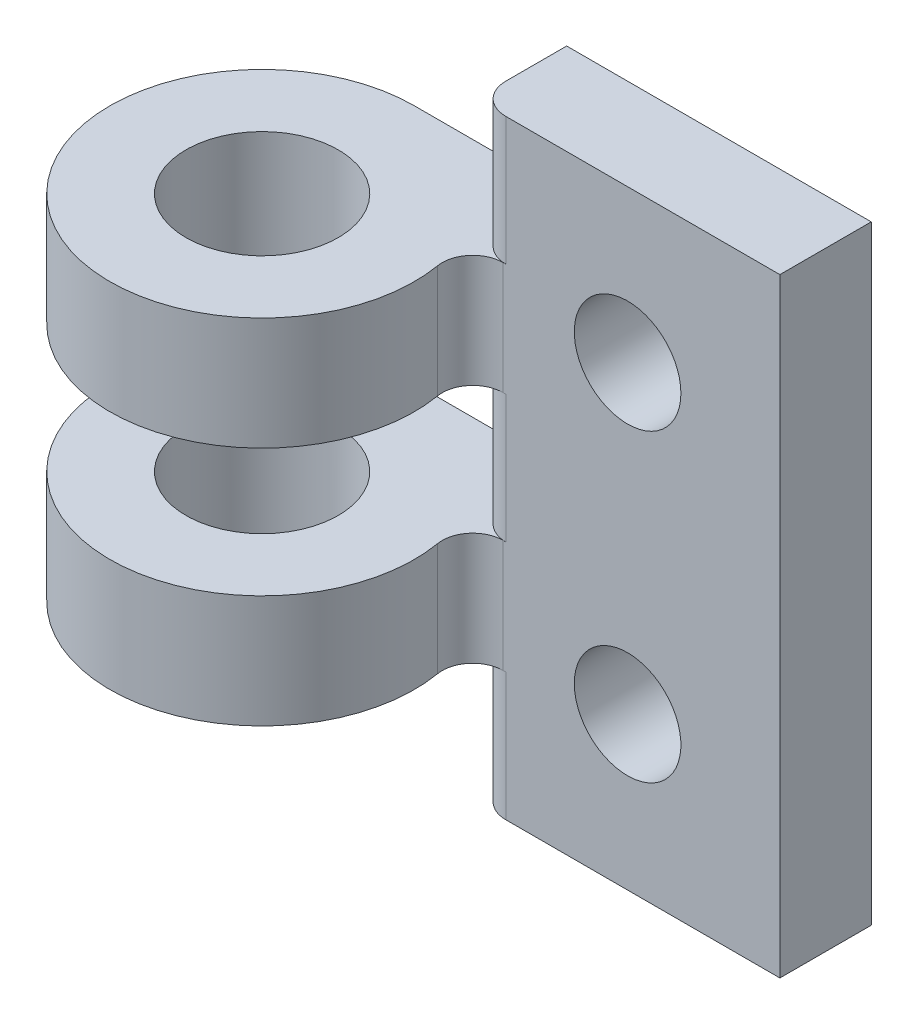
from build123d import *

# Parameters (mm, degrees)
SKETCH1_W           = 10
SKETCH1_H           = 20
SKETCH1_R           = 1.75
BOSS_EXTRUDE1_DEPTH = 1.5
BOSS_EXTRUDE2_DEPTH = 10
SKETCH3_W           = 10
SKETCH3_H           = 4.2
CUT_EXTRUDE1_DEPTH  = 10
SKETCH4_R           = 2.5
CUT_EXTRUDE2_DEPTH  = 20
FILLET1_R           = 1
FILLET2_R           = 1


with BuildPart() as part:
    # Sketch1 → Boss-Extrude1 (new, symmetric)
    with BuildSketch(Plane.XY):
        Rectangle(SKETCH1_W, SKETCH1_H)
        with Locations((0, 5)):
            Circle(SKETCH1_R, mode=Mode.SUBTRACT)
        with Locations(Location((0, -5, 0), (0, 0, 180))):
            Circle(SKETCH1_R, mode=Mode.SUBTRACT)
    extrude(amount=BOSS_EXTRUDE1_DEPTH, both=True)

    # Sketch2 → Boss-Extrude2 (add, symmetric)
    with BuildSketch(Plane(origin=(0, 0, 0), x_dir=(1, 0, 0), z_dir=(0, 1, 0))):
        with BuildLine():
            Line((-5, 1.5), (-5, -1.5))
            Line((-5, -1.5), (-5.417424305, -1.5))
            ThreePointArc((-5.417424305, -1.5), (-12.738612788, -7.683300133), (-10, 1.5))
            Line((-10, 1.5), (-5, 1.5))
        make_face()
    extrude(amount=BOSS_EXTRUDE2_DEPTH, both=True)

    # Sketch3 → Cut-Extrude1 (cut, symmetric)
    with BuildSketch(Plane.XY.offset(1.5)):
        with Locations((-10, 0)):
            Rectangle(SKETCH3_W, SKETCH3_H)
        with Locations((-10, 7.9)):
            Rectangle(SKETCH3_W, SKETCH3_H)
        with Locations((-10, -7.9)):
            Rectangle(SKETCH3_W, SKETCH3_H)
    extrude(amount=CUT_EXTRUDE1_DEPTH, both=True, mode=Mode.SUBTRACT)

    # Sketch4 → Cut-Extrude2 (cut)
    with BuildSketch(Plane(origin=(0, 5.8, 0), x_dir=(1, 0, 0), z_dir=(0, 1, 0))):
        with Locations(Location((-10, -3.5, 0), (0, 0, 180))):
            Circle(SKETCH4_R)
    extrude(amount=-CUT_EXTRUDE2_DEPTH, mode=Mode.SUBTRACT)

    # Fillet1
    fillet1_edges = [part.edges().sort_by_distance(p)[0] for p in [
        (-5, -7.9, 1.5),
        (-5, 7.9, 1.5),
        (-5, 0, 1.5),
    ]]
    fillet(fillet1_edges, radius=FILLET1_R)

    # Fillet2
    fillet2_edges = [part.edges().sort_by_distance(p)[0] for p in [
        (-5.417424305, 3.95, 1.5),
        (-5.417424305, -3.95, 1.5),
    ]]
    fillet(fillet2_edges, radius=FILLET2_R)


solid = part.part
